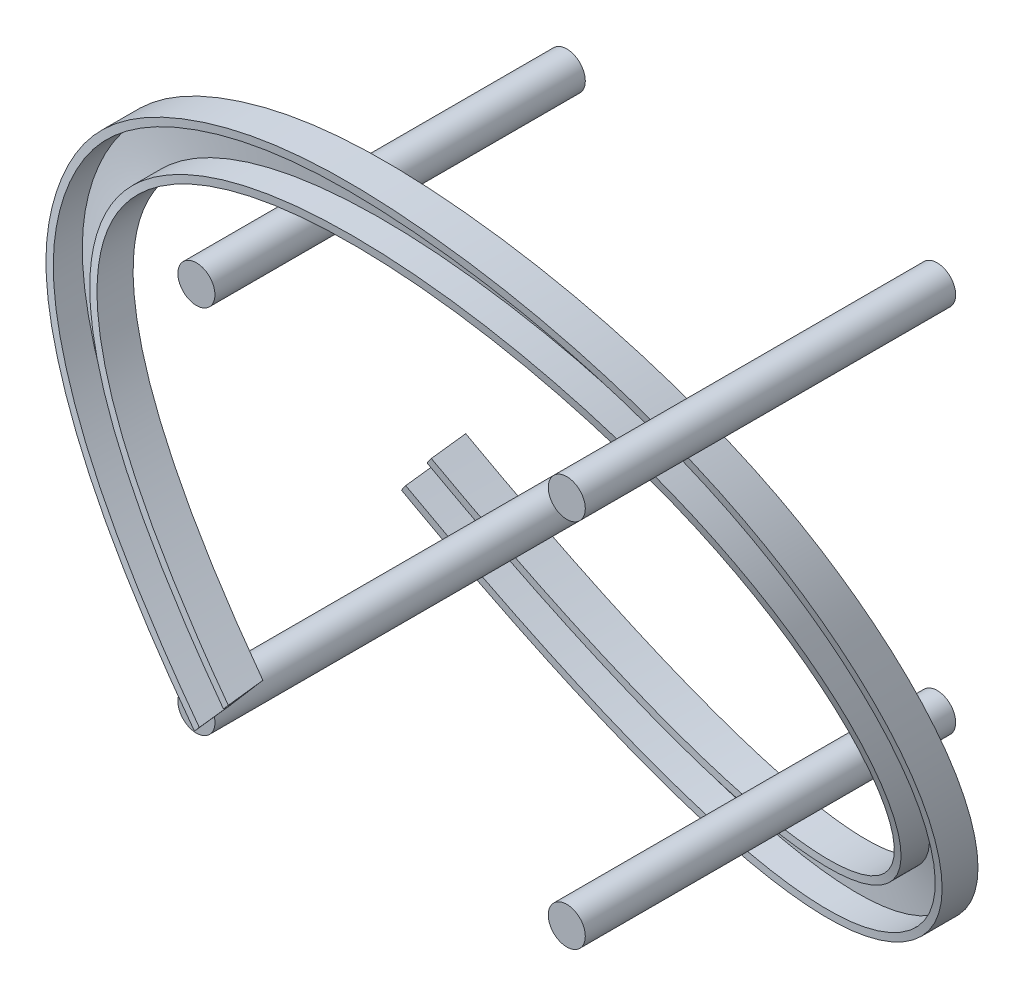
ISO-10303-21;
HEADER;
FILE_DESCRIPTION(('STEP AP214'),'2;1');
FILE_NAME('part.step','',(''),(''),'','','');
FILE_SCHEMA(('AUTOMOTIVE_DESIGN { 1 0 10303 214 1 1 1 1 }'));
ENDSEC;
DATA;
#1=APPLICATION_CONTEXT('core data for automotive mechanical design processes');
#2=APPLICATION_PROTOCOL_DEFINITION('international standard','automotive_design',2000,#1);
#3=PRODUCT_CONTEXT('',#1,'mechanical');
#4=PRODUCT('Part','Part','',(#3));
#5=PRODUCT_RELATED_PRODUCT_CATEGORY('part','',(#4));
#6=PRODUCT_DEFINITION_FORMATION('','',#4);
#7=PRODUCT_DEFINITION_CONTEXT('part definition',#1,'design');
#8=PRODUCT_DEFINITION('design','',#6,#7);
#9=PRODUCT_DEFINITION_SHAPE('','',#8);
#10=(LENGTH_UNIT() NAMED_UNIT(*) SI_UNIT(.MILLI.,.METRE.));
#11=(NAMED_UNIT(*) PLANE_ANGLE_UNIT() SI_UNIT($,.RADIAN.));
#12=(NAMED_UNIT(*) SI_UNIT($,.STERADIAN.) SOLID_ANGLE_UNIT());
#13=UNCERTAINTY_MEASURE_WITH_UNIT(LENGTH_MEASURE(1.E-05),#10,'distance_accuracy_value','');
#14=(GEOMETRIC_REPRESENTATION_CONTEXT(3) GLOBAL_UNCERTAINTY_ASSIGNED_CONTEXT((#13)) GLOBAL_UNIT_ASSIGNED_CONTEXT((#10,
#11,#12)) REPRESENTATION_CONTEXT('',''));
#15=CARTESIAN_POINT('',(0.,0.,0.));
#16=DIRECTION('',(0.,0.,1.));
#17=DIRECTION('',(1.,0.,0.));
#18=AXIS2_PLACEMENT_3D('',#15,#16,#17);
#19=CARTESIAN_POINT('',(-77.7613171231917,-50.7166657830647,9.96616393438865));
#20=CARTESIAN_POINT('',(-70.2801573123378,-55.968511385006,9.21165026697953));
#21=CARTESIAN_POINT('',(-55.8880572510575,-65.2955827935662,8.02362976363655));
#22=CARTESIAN_POINT('',(-29.3261450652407,-79.5413742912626,6.83805830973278));
#23=CARTESIAN_POINT('',(6.34820167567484,-91.9746411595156,7.54417392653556));
#24=CARTESIAN_POINT('',(40.8569061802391,-90.120545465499,13.0177509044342));
#25=CARTESIAN_POINT('',(64.3519997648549,-71.9275437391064,22.7748296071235));
#26=CARTESIAN_POINT('',(75.4857140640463,-41.7258650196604,35.8287291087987));
#27=CARTESIAN_POINT('',(69.3896475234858,-7.34019137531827,49.2249989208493));
#28=CARTESIAN_POINT('',(50.1268643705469,20.1377350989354,59.5248620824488));
#29=CARTESIAN_POINT('',(22.3316370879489,42.5422765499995,67.8998145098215));
#30=CARTESIAN_POINT('',(-20.7548953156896,60.2405934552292,75.4014445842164));
#31=CARTESIAN_POINT('',(-63.0830964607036,62.6392740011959,81.795131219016));
#32=CARTESIAN_POINT('',(-83.6748822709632,51.1117127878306,87.2817350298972));
#33=CARTESIAN_POINT('',(-87.7917811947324,35.3170567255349,91.9059318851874));
#34=CARTESIAN_POINT('',(-81.6955593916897,17.1834374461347,96.7966693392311));
#35=CARTESIAN_POINT('',(-67.6596586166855,-2.11885116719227,101.679685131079));
#36=CARTESIAN_POINT('',(-50.0130194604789,-20.3508399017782,106.190499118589));
#37=CARTESIAN_POINT('',(-38.9034197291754,-30.4265533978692,108.667366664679));
#38=CARTESIAN_POINT('',(-32.7326646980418,-35.7145213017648,109.966163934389));
#39=CARTESIAN_POINT('',(-76.6084745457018,-49.0823604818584,9.96574683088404));
#40=CARTESIAN_POINT('',(-69.1673767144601,-54.307029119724,9.21123316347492));
#41=CARTESIAN_POINT('',(-54.8554006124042,-63.5797466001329,8.02321266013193));
#42=CARTESIAN_POINT('',(-28.5018750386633,-77.7123603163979,6.83764120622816));
#43=CARTESIAN_POINT('',(6.7527595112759,-89.9777411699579,7.54375682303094));
#44=CARTESIAN_POINT('',(40.2862481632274,-88.0546648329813,13.0173338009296));
#45=CARTESIAN_POINT('',(62.6367929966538,-70.673355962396,22.7744125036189));
#46=CARTESIAN_POINT('',(73.3852290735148,-41.6528652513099,35.8283120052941));
#47=CARTESIAN_POINT('',(67.4655177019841,-8.08688294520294,49.2245818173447));
#48=CARTESIAN_POINT('',(48.6444524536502,18.758137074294,59.5244449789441));
#49=CARTESIAN_POINT('',(21.3655647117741,40.7472231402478,67.8993974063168));
#50=CARTESIAN_POINT('',(-21.2170765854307,58.3092429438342,75.4010274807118));
#51=CARTESIAN_POINT('',(-63.0787860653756,60.5043856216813,81.7947141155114));
#52=CARTESIAN_POINT('',(-82.0550854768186,49.5342147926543,87.2813179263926));
#53=CARTESIAN_POINT('',(-85.6464661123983,35.5547551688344,91.9055147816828));
#54=CARTESIAN_POINT('',(-79.9632474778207,18.2097370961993,96.7962522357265));
#55=CARTESIAN_POINT('',(-66.1318442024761,-0.819427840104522,101.679268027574));
#56=CARTESIAN_POINT('',(-48.6258235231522,-18.9080560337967,106.190082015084));
#57=CARTESIAN_POINT('',(-37.5715977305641,-28.9347442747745,108.666949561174));
#58=CARTESIAN_POINT('',(-31.4285296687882,-34.1981995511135,109.965746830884));
#59=B_SPLINE_SURFACE_WITH_KNOTS('',1,3,((#19,#20,#21,#22,#23,#24,#25,#26,#27,#28,#29,#30,#31,
#32,#33,#34,#35,#36,#37,#38),(#39,#40,#41,#42,#43,#44,#45,#46,#47,#48,#49,#50,#51,#52,#53,#54,
#55,#56,#57,#58)),.UNSPECIFIED.,.F.,.F.,.F.,(2,2),(4,1,1,1,1,1,1,1,1,1,1,1,1,1,1,1,1,4),(0.,
0.03125),(0.,0.0262499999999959,0.0524999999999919,0.105,0.187499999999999,0.257812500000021,
0.328125,0.43359375,0.494089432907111,0.5390625,0.64453125,0.75,0.8125,0.859375,
0.906250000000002,0.953125,0.9765625,1.),.UNSPECIFIED.);
#60=DIRECTION('',(-0.576421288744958,-0.817152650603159,0.000208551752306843));
#61=VECTOR('',#60,1.);
#62=CARTESIAN_POINT('',(-77.7613171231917,-50.7166657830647,9.96616393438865));
#63=LINE('',#62,#61);
#64=CARTESIAN_POINT('',(-76.6084745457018,-49.0823604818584,9.96574683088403));
#65=VERTEX_POINT('',#64);
#66=CARTESIAN_POINT('',(-77.7613171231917,-50.7166657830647,9.96616393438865));
#67=VERTEX_POINT('',#66);
#68=EDGE_CURVE('E213',#65,#67,#63,.T.);
#69=CARTESIAN_POINT('',(-77.7613171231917,-50.7166657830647,9.96616393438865));
#70=CARTESIAN_POINT('',(-70.2801573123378,-55.968511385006,9.21165026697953));
#71=CARTESIAN_POINT('',(-55.8880572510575,-65.2955827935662,8.02362976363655));
#72=CARTESIAN_POINT('',(-29.3261450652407,-79.5413742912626,6.83805830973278));
#73=CARTESIAN_POINT('',(6.34820167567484,-91.9746411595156,7.54417392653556));
#74=CARTESIAN_POINT('',(40.8569061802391,-90.120545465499,13.0177509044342));
#75=CARTESIAN_POINT('',(64.3519997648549,-71.9275437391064,22.7748296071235));
#76=CARTESIAN_POINT('',(75.4857140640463,-41.7258650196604,35.8287291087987));
#77=CARTESIAN_POINT('',(69.3896475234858,-7.34019137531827,49.2249989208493));
#78=CARTESIAN_POINT('',(50.1268643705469,20.1377350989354,59.5248620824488));
#79=CARTESIAN_POINT('',(22.3316370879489,42.5422765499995,67.8998145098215));
#80=CARTESIAN_POINT('',(-20.7548953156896,60.2405934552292,75.4014445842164));
#81=CARTESIAN_POINT('',(-63.0830964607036,62.6392740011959,81.795131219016));
#82=CARTESIAN_POINT('',(-83.6748822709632,51.1117127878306,87.2817350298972));
#83=CARTESIAN_POINT('',(-87.7917811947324,35.3170567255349,91.9059318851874));
#84=CARTESIAN_POINT('',(-81.6955593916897,17.1834374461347,96.7966693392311));
#85=CARTESIAN_POINT('',(-67.6596586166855,-2.11885116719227,101.679685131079));
#86=CARTESIAN_POINT('',(-50.0130194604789,-20.3508399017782,106.190499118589));
#87=CARTESIAN_POINT('',(-38.9034197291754,-30.4265533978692,108.667366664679));
#88=CARTESIAN_POINT('',(-32.7326646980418,-35.7145213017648,109.966163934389));
#89=B_SPLINE_CURVE_WITH_KNOTS('',3,(#69,#70,#71,#72,#73,#74,#75,#76,#77,#78,#79,#80,#81,#82,#83,
#84,#85,#86,#87,#88),.UNSPECIFIED.,.F.,.F.,(4,1,1,1,1,1,1,1,1,1,1,1,1,1,1,1,1,4),(0.,
0.0262499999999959,0.0524999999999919,0.105,0.187499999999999,0.257812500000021,0.328125,
0.43359375,0.494089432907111,0.5390625,0.64453125,0.75,0.8125,0.859375,0.906250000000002,
0.953125,0.9765625,1.),.UNSPECIFIED.);
#90=CARTESIAN_POINT('',(-32.7326646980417,-35.7145213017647,109.966163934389));
#91=VERTEX_POINT('',#90);
#92=EDGE_CURVE('E138',#67,#91,#89,.T.);
#93=DIRECTION('',(-0.652067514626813,-0.758160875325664,0.000208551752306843));
#94=VECTOR('',#93,1.);
#95=CARTESIAN_POINT('',(-32.7326646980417,-35.7145213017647,109.966163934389));
#96=LINE('',#95,#94);
#97=CARTESIAN_POINT('',(-31.4285296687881,-34.1981995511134,109.965746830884));
#98=VERTEX_POINT('',#97);
#99=EDGE_CURVE('E135',#98,#91,#96,.T.);
#100=CARTESIAN_POINT('',(-76.6084745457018,-49.0823604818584,9.96574683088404));
#101=CARTESIAN_POINT('',(-69.1673767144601,-54.307029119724,9.21123316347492));
#102=CARTESIAN_POINT('',(-54.8554006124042,-63.5797466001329,8.02321266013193));
#103=CARTESIAN_POINT('',(-28.5018750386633,-77.7123603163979,6.83764120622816));
#104=CARTESIAN_POINT('',(6.7527595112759,-89.9777411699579,7.54375682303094));
#105=CARTESIAN_POINT('',(40.2862481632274,-88.0546648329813,13.0173338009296));
#106=CARTESIAN_POINT('',(62.6367929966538,-70.673355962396,22.7744125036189));
#107=CARTESIAN_POINT('',(73.3852290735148,-41.6528652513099,35.8283120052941));
#108=CARTESIAN_POINT('',(67.4655177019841,-8.08688294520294,49.2245818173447));
#109=CARTESIAN_POINT('',(48.6444524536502,18.758137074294,59.5244449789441));
#110=CARTESIAN_POINT('',(21.3655647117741,40.7472231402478,67.8993974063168));
#111=CARTESIAN_POINT('',(-21.2170765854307,58.3092429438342,75.4010274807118));
#112=CARTESIAN_POINT('',(-63.0787860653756,60.5043856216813,81.7947141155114));
#113=CARTESIAN_POINT('',(-82.0550854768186,49.5342147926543,87.2813179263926));
#114=CARTESIAN_POINT('',(-85.6464661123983,35.5547551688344,91.9055147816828));
#115=CARTESIAN_POINT('',(-79.9632474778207,18.2097370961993,96.7962522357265));
#116=CARTESIAN_POINT('',(-66.1318442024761,-0.819427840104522,101.679268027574));
#117=CARTESIAN_POINT('',(-48.6258235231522,-18.9080560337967,106.190082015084));
#118=CARTESIAN_POINT('',(-37.5715977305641,-28.9347442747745,108.666949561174));
#119=CARTESIAN_POINT('',(-31.4285296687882,-34.1981995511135,109.965746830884));
#120=B_SPLINE_CURVE_WITH_KNOTS('',3,(#100,#101,#102,#103,#104,#105,#106,#107,#108,#109,#110,
#111,#112,#113,#114,#115,#116,#117,#118,#119),.UNSPECIFIED.,.F.,.F.,(4,1,1,1,1,1,1,1,1,1,1,1,1,
1,1,1,1,4),(0.,0.0262499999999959,0.0524999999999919,0.105,0.187499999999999,0.257812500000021,
0.328125,0.43359375,0.494089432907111,0.5390625,0.64453125,0.75,0.8125,0.859375,
0.906250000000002,0.953125,0.9765625,1.),.UNSPECIFIED.);
#121=EDGE_CURVE('E79',#65,#98,#120,.T.);
#122=ORIENTED_EDGE('',*,*,#68,.T.);
#123=ORIENTED_EDGE('',*,*,#92,.T.);
#124=ORIENTED_EDGE('',*,*,#99,.F.);
#125=ORIENTED_EDGE('',*,*,#121,.F.);
#126=EDGE_LOOP('',(#122,#123,#124,#125));
#127=FACE_BOUND('',#126,.T.);
#128=ADVANCED_FACE('F60',(#127),#59,.F.);
#129=CARTESIAN_POINT('',(-76.6084745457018,-49.0823604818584,9.96574683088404));
#130=CARTESIAN_POINT('',(-69.1673767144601,-54.307029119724,9.21123316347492));
#131=CARTESIAN_POINT('',(-54.8554006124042,-63.5797466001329,8.02321266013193));
#132=CARTESIAN_POINT('',(-28.5018750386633,-77.7123603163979,6.83764120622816));
#133=CARTESIAN_POINT('',(6.7527595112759,-89.9777411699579,7.54375682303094));
#134=CARTESIAN_POINT('',(40.2862481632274,-88.0546648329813,13.0173338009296));
#135=CARTESIAN_POINT('',(62.6367929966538,-70.673355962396,22.7744125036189));
#136=CARTESIAN_POINT('',(73.3852290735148,-41.6528652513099,35.8283120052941));
#137=CARTESIAN_POINT('',(67.4655177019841,-8.08688294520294,49.2245818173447));
#138=CARTESIAN_POINT('',(48.6444524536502,18.758137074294,59.5244449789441));
#139=CARTESIAN_POINT('',(21.3655647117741,40.7472231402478,67.8993974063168));
#140=CARTESIAN_POINT('',(-21.2170765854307,58.3092429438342,75.4010274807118));
#141=CARTESIAN_POINT('',(-63.0787860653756,60.5043856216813,81.7947141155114));
#142=CARTESIAN_POINT('',(-82.0550854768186,49.5342147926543,87.2813179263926));
#143=CARTESIAN_POINT('',(-85.6464661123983,35.5547551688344,91.9055147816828));
#144=CARTESIAN_POINT('',(-79.9632474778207,18.2097370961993,96.7962522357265));
#145=CARTESIAN_POINT('',(-66.1318442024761,-0.819427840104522,101.679268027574));
#146=CARTESIAN_POINT('',(-48.6258235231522,-18.9080560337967,106.190082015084));
#147=CARTESIAN_POINT('',(-37.5715977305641,-28.9347442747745,108.666949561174));
#148=CARTESIAN_POINT('',(-31.4285296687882,-34.1981995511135,109.965746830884));
#149=CARTESIAN_POINT('',(-77.2854364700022,-48.60737347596,0.));
#150=CARTESIAN_POINT('',(-69.8555343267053,-53.8486354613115,-0.754513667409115));
#151=CARTESIAN_POINT('',(-55.5659496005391,-63.1545396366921,-1.9425341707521));
#152=CARTESIAN_POINT('',(-29.2590050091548,-77.3734361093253,-3.12810562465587));
#153=CARTESIAN_POINT('',(5.92664702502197,-89.8125369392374,-2.42199000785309));
#154=CARTESIAN_POINT('',(39.4326265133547,-88.2927713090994,3.05158697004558));
#155=CARTESIAN_POINT('',(62.1199851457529,-71.3838749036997,12.8086656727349));
#156=CARTESIAN_POINT('',(73.3572274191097,-42.5214642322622,25.8625651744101));
#157=CARTESIAN_POINT('',(67.7762644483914,-8.88170955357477,39.2588349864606));
#158=CARTESIAN_POINT('',(49.2164387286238,18.1466127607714,49.5586981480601));
#159=CARTESIAN_POINT('',(22.1087997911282,40.3496302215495,57.9336505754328));
#160=CARTESIAN_POINT('',(-20.4180080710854,58.1201440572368,65.4352806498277));
#161=CARTESIAN_POINT('',(-62.1960420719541,60.5083864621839,71.8289672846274));
#162=CARTESIAN_POINT('',(-81.4044939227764,50.2056189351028,77.3155710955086));
#163=CARTESIAN_POINT('',(-85.7469806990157,36.4415679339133,81.9397679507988));
#164=CARTESIAN_POINT('',(-80.3894091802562,18.9249589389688,86.8305054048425));
#165=CARTESIAN_POINT('',(-66.6707264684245,-0.189046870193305,91.7135211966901));
#166=CARTESIAN_POINT('',(-49.2238373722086,-18.3359679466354,96.2243351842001));
#167=CARTESIAN_POINT('',(-38.189825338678,-28.3856035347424,98.7012027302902));
#168=CARTESIAN_POINT('',(-32.0568641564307,-33.660532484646,100.));
#169=B_SPLINE_SURFACE_WITH_KNOTS('',1,3,((#129,#130,#131,#132,#133,#134,#135,#136,#137,#138,
#139,#140,#141,#142,#143,#144,#145,#146,#147,#148),(#149,#150,#151,#152,#153,#154,#155,#156,
#157,#158,#159,#160,#161,#162,#163,#164,#165,#166,#167,#168)),.UNSPECIFIED.,.F.,.F.,.F.,(2,2),
(4,1,1,1,1,1,1,1,1,1,1,1,1,1,1,1,1,4),(0.03125,0.1875),(0.,0.0262499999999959,
0.0524999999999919,0.105,0.187499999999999,0.257812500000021,0.328125,0.43359375,
0.494089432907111,0.5390625,0.64453125,0.75,0.8125,0.859375,0.906250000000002,0.953125,
0.9765625,1.),.UNSPECIFIED.);
#170=DIRECTION('',(0.0676961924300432,-0.0474987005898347,0.996574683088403));
#171=VECTOR('',#170,1.);
#172=CARTESIAN_POINT('',(-76.6084745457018,-49.0823604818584,9.96574683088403));
#173=LINE('',#172,#171);
#174=CARTESIAN_POINT('',(-77.2854364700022,-48.60737347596,0.));
#175=VERTEX_POINT('',#174);
#176=EDGE_CURVE('E13',#175,#65,#173,.T.);
#177=DIRECTION('',(0.0628334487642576,-0.0537667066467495,0.996574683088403));
#178=VECTOR('',#177,1.);
#179=CARTESIAN_POINT('',(-31.4285296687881,-34.1981995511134,109.965746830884));
#180=LINE('',#179,#178);
#181=CARTESIAN_POINT('',(-32.0568641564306,-33.6605324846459,100.));
#182=VERTEX_POINT('',#181);
#183=EDGE_CURVE('E64',#182,#98,#180,.T.);
#184=CARTESIAN_POINT('',(-77.2854364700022,-48.60737347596,0.));
#185=CARTESIAN_POINT('',(-69.8555343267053,-53.8486354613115,-0.754513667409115));
#186=CARTESIAN_POINT('',(-55.5659496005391,-63.1545396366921,-1.9425341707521));
#187=CARTESIAN_POINT('',(-29.2590050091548,-77.3734361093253,-3.12810562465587));
#188=CARTESIAN_POINT('',(5.92664702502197,-89.8125369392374,-2.42199000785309));
#189=CARTESIAN_POINT('',(39.4326265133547,-88.2927713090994,3.05158697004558));
#190=CARTESIAN_POINT('',(62.1199851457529,-71.3838749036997,12.8086656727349));
#191=CARTESIAN_POINT('',(73.3572274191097,-42.5214642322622,25.8625651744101));
#192=CARTESIAN_POINT('',(67.7762644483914,-8.88170955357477,39.2588349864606));
#193=CARTESIAN_POINT('',(49.2164387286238,18.1466127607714,49.5586981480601));
#194=CARTESIAN_POINT('',(22.1087997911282,40.3496302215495,57.9336505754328));
#195=CARTESIAN_POINT('',(-20.4180080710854,58.1201440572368,65.4352806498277));
#196=CARTESIAN_POINT('',(-62.1960420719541,60.5083864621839,71.8289672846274));
#197=CARTESIAN_POINT('',(-81.4044939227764,50.2056189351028,77.3155710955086));
#198=CARTESIAN_POINT('',(-85.7469806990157,36.4415679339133,81.9397679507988));
#199=CARTESIAN_POINT('',(-80.3894091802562,18.9249589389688,86.8305054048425));
#200=CARTESIAN_POINT('',(-66.6707264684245,-0.189046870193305,91.7135211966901));
#201=CARTESIAN_POINT('',(-49.2238373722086,-18.3359679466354,96.2243351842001));
#202=CARTESIAN_POINT('',(-38.189825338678,-28.3856035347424,98.7012027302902));
#203=CARTESIAN_POINT('',(-32.0568641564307,-33.660532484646,100.));
#204=B_SPLINE_CURVE_WITH_KNOTS('',3,(#184,#185,#186,#187,#188,#189,#190,#191,#192,#193,#194,
#195,#196,#197,#198,#199,#200,#201,#202,#203),.UNSPECIFIED.,.F.,.F.,(4,1,1,1,1,1,1,1,1,1,1,1,1,
1,1,1,1,4),(0.,0.0262499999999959,0.0524999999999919,0.105,0.187499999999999,0.257812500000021,
0.328125,0.43359375,0.494089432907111,0.5390625,0.64453125,0.75,0.8125,0.859375,
0.906250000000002,0.953125,0.9765625,1.),.UNSPECIFIED.);
#205=EDGE_CURVE('E123',#175,#182,#204,.T.);
#206=ORIENTED_EDGE('',*,*,#176,.T.);
#207=ORIENTED_EDGE('',*,*,#121,.T.);
#208=ORIENTED_EDGE('',*,*,#183,.F.);
#209=ORIENTED_EDGE('',*,*,#205,.F.);
#210=EDGE_LOOP('',(#206,#207,#208,#209));
#211=FACE_BOUND('',#210,.T.);
#212=ADVANCED_FACE('F127',(#211),#169,.F.);
#213=CARTESIAN_POINT('',(-77.2854364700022,-48.60737347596,0.));
#214=CARTESIAN_POINT('',(-69.8555343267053,-53.8486354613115,-0.754513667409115));
#215=CARTESIAN_POINT('',(-55.5659496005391,-63.1545396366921,-1.9425341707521));
#216=CARTESIAN_POINT('',(-29.2590050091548,-77.3734361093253,-3.12810562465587));
#217=CARTESIAN_POINT('',(5.92664702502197,-89.8125369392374,-2.42199000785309));
#218=CARTESIAN_POINT('',(39.4326265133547,-88.2927713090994,3.05158697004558));
#219=CARTESIAN_POINT('',(62.1199851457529,-71.3838749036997,12.8086656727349));
#220=CARTESIAN_POINT('',(73.3572274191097,-42.5214642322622,25.8625651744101));
#221=CARTESIAN_POINT('',(67.7762644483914,-8.88170955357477,39.2588349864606));
#222=CARTESIAN_POINT('',(49.2164387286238,18.1466127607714,49.5586981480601));
#223=CARTESIAN_POINT('',(22.1087997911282,40.3496302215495,57.9336505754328));
#224=CARTESIAN_POINT('',(-20.4180080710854,58.1201440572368,65.4352806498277));
#225=CARTESIAN_POINT('',(-62.1960420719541,60.5083864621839,71.8289672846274));
#226=CARTESIAN_POINT('',(-81.4044939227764,50.2056189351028,77.3155710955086));
#227=CARTESIAN_POINT('',(-85.7469806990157,36.4415679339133,81.9397679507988));
#228=CARTESIAN_POINT('',(-80.3894091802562,18.9249589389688,86.8305054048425));
#229=CARTESIAN_POINT('',(-66.6707264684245,-0.189046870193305,91.7135211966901));
#230=CARTESIAN_POINT('',(-49.2238373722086,-18.3359679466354,96.2243351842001));
#231=CARTESIAN_POINT('',(-38.189825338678,-28.3856035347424,98.7012027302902));
#232=CARTESIAN_POINT('',(-32.0568641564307,-33.660532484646,100.));
#233=CARTESIAN_POINT('',(-85.3553345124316,-60.0475105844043,0.00291972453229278));
#234=CARTESIAN_POINT('',(-77.6449985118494,-65.4790113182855,-0.751593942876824));
#235=CARTESIAN_POINT('',(-62.7945460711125,-75.1653929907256,-1.93961444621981));
#236=CARTESIAN_POINT('',(-35.0288951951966,-90.1765339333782,-3.12518590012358));
#237=CARTESIAN_POINT('',(3.09474217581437,-103.790836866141,-2.4190702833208));
#238=CARTESIAN_POINT('',(43.4272326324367,-102.753935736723,3.05450669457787));
#239=CARTESIAN_POINT('',(74.1264325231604,-80.1631893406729,12.8115853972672));
#240=CARTESIAN_POINT('',(88.0606223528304,-43.0324626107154,25.8654848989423));
#241=CARTESIAN_POINT('',(81.2451731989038,-3.654868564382,39.2617547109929));
#242=CARTESIAN_POINT('',(59.5933221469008,27.8037989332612,49.5616178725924));
#243=CARTESIAN_POINT('',(28.8713064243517,52.9150040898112,57.9365702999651));
#244=CARTESIAN_POINT('',(-17.1827391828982,71.6395976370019,65.43820037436));
#245=CARTESIAN_POINT('',(-62.2262148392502,75.4526051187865,71.8318870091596));
#246=CARTESIAN_POINT('',(-92.7430714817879,61.2481049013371,77.3184908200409));
#247=CARTESIAN_POINT('',(-100.764186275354,34.7776788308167,81.942687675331));
#248=CARTESIAN_POINT('',(-92.5155925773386,11.7408613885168,86.8334251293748));
#249=CARTESIAN_POINT('',(-77.3654273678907,-9.28501015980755,91.7164409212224));
#250=CARTESIAN_POINT('',(-58.934208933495,-28.4354550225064,96.2272549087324));
#251=CARTESIAN_POINT('',(-47.512579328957,-38.8282673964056,98.7041224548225));
#252=CARTESIAN_POINT('',(-41.1858093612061,-44.2747847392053,100.002919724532));
#253=B_SPLINE_SURFACE_WITH_KNOTS('',1,3,((#213,#214,#215,#216,#217,#218,#219,#220,#221,#222,
#223,#224,#225,#226,#227,#228,#229,#230,#231,#232),(#233,#234,#235,#236,#237,#238,#239,#240,
#241,#242,#243,#244,#245,#246,#247,#248,#249,#250,#251,#252)),.UNSPECIFIED.,.F.,.F.,.F.,(2,2),
(4,1,1,1,1,1,1,1,1,1,1,1,1,1,1,1,1,4),(0.1875,0.40625),(0.,0.0262499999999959,
0.0524999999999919,0.105,0.187499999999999,0.257812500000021,0.328125,0.43359375,
0.494089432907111,0.5390625,0.64453125,0.75,0.8125,0.859375,0.906250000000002,0.953125,
0.9765625,1.),.UNSPECIFIED.);
#254=DIRECTION('',(0.576421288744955,0.817152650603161,-0.000208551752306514));
#255=VECTOR('',#254,1.);
#256=CARTESIAN_POINT('',(-77.2854364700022,-48.60737347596,0.));
#257=LINE('',#256,#255);
#258=CARTESIAN_POINT('',(-85.3553345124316,-60.0475105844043,0.00291972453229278));
#259=VERTEX_POINT('',#258);
#260=EDGE_CURVE('E70',#259,#175,#257,.T.);
#261=DIRECTION('',(0.65206751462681,0.758160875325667,-0.000208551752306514));
#262=VECTOR('',#261,1.);
#263=CARTESIAN_POINT('',(-32.0568641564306,-33.6605324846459,100.));
#264=LINE('',#263,#262);
#265=CARTESIAN_POINT('',(-41.185809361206,-44.2747847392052,100.002919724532));
#266=VERTEX_POINT('',#265);
#267=EDGE_CURVE('E137',#266,#182,#264,.T.);
#268=CARTESIAN_POINT('',(-85.3553345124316,-60.0475105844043,0.00291972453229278));
#269=CARTESIAN_POINT('',(-77.6449985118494,-65.4790113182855,-0.751593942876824));
#270=CARTESIAN_POINT('',(-62.7945460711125,-75.1653929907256,-1.93961444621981));
#271=CARTESIAN_POINT('',(-35.0288951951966,-90.1765339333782,-3.12518590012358));
#272=CARTESIAN_POINT('',(3.09474217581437,-103.790836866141,-2.4190702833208));
#273=CARTESIAN_POINT('',(43.4272326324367,-102.753935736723,3.05450669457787));
#274=CARTESIAN_POINT('',(74.1264325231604,-80.1631893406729,12.8115853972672));
#275=CARTESIAN_POINT('',(88.0606223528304,-43.0324626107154,25.8654848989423));
#276=CARTESIAN_POINT('',(81.2451731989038,-3.654868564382,39.2617547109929));
#277=CARTESIAN_POINT('',(59.5933221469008,27.8037989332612,49.5616178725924));
#278=CARTESIAN_POINT('',(28.8713064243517,52.9150040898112,57.9365702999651));
#279=CARTESIAN_POINT('',(-17.1827391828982,71.6395976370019,65.43820037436));
#280=CARTESIAN_POINT('',(-62.2262148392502,75.4526051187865,71.8318870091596));
#281=CARTESIAN_POINT('',(-92.7430714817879,61.2481049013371,77.3184908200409));
#282=CARTESIAN_POINT('',(-100.764186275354,34.7776788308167,81.942687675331));
#283=CARTESIAN_POINT('',(-92.5155925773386,11.7408613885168,86.8334251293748));
#284=CARTESIAN_POINT('',(-77.3654273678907,-9.28501015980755,91.7164409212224));
#285=CARTESIAN_POINT('',(-58.934208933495,-28.4354550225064,96.2272549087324));
#286=CARTESIAN_POINT('',(-47.512579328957,-38.8282673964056,98.7041224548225));
#287=CARTESIAN_POINT('',(-41.1858093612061,-44.2747847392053,100.002919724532));
#288=B_SPLINE_CURVE_WITH_KNOTS('',3,(#268,#269,#270,#271,#272,#273,#274,#275,#276,#277,#278,
#279,#280,#281,#282,#283,#284,#285,#286,#287),.UNSPECIFIED.,.F.,.F.,(4,1,1,1,1,1,1,1,1,1,1,1,1,
1,1,1,1,4),(0.,0.0262499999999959,0.0524999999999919,0.105,0.187499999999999,0.257812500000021,
0.328125,0.43359375,0.494089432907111,0.5390625,0.64453125,0.75,0.8125,0.859375,
0.906250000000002,0.953125,0.9765625,1.),.UNSPECIFIED.);
#289=EDGE_CURVE('E166',#259,#266,#288,.T.);
#290=ORIENTED_EDGE('',*,*,#260,.T.);
#291=ORIENTED_EDGE('',*,*,#205,.T.);
#292=ORIENTED_EDGE('',*,*,#267,.F.);
#293=ORIENTED_EDGE('',*,*,#289,.F.);
#294=EDGE_LOOP('',(#290,#291,#292,#293));
#295=FACE_BOUND('',#294,.T.);
#296=ADVANCED_FACE('F171',(#295),#253,.F.);
#297=CARTESIAN_POINT('',(-85.3553345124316,-60.0475105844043,0.00291972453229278));
#298=CARTESIAN_POINT('',(-77.6449985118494,-65.4790113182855,-0.751593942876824));
#299=CARTESIAN_POINT('',(-62.7945460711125,-75.1653929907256,-1.93961444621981));
#300=CARTESIAN_POINT('',(-35.0288951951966,-90.1765339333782,-3.12518590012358));
#301=CARTESIAN_POINT('',(3.09474217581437,-103.790836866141,-2.4190702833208));
#302=CARTESIAN_POINT('',(43.4272326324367,-102.753935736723,3.05450669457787));
#303=CARTESIAN_POINT('',(74.1264325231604,-80.1631893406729,12.8115853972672));
#304=CARTESIAN_POINT('',(88.0606223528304,-43.0324626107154,25.8654848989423));
#305=CARTESIAN_POINT('',(81.2451731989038,-3.654868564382,39.2617547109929));
#306=CARTESIAN_POINT('',(59.5933221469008,27.8037989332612,49.5616178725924));
#307=CARTESIAN_POINT('',(28.8713064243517,52.9150040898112,57.9365702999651));
#308=CARTESIAN_POINT('',(-17.1827391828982,71.6395976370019,65.43820037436));
#309=CARTESIAN_POINT('',(-62.2262148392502,75.4526051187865,71.8318870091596));
#310=CARTESIAN_POINT('',(-92.7430714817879,61.2481049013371,77.3184908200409));
#311=CARTESIAN_POINT('',(-100.764186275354,34.7776788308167,81.942687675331));
#312=CARTESIAN_POINT('',(-92.5155925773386,11.7408613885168,86.8334251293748));
#313=CARTESIAN_POINT('',(-77.3654273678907,-9.28501015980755,91.7164409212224));
#314=CARTESIAN_POINT('',(-58.934208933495,-28.4354550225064,96.2272549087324));
#315=CARTESIAN_POINT('',(-47.512579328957,-38.8282673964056,98.7041224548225));
#316=CARTESIAN_POINT('',(-41.1858093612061,-44.2747847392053,100.002919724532));
#317=CARTESIAN_POINT('',(-84.6783725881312,-60.5224975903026,9.96866655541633));
#318=CARTESIAN_POINT('',(-76.9568408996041,-65.937404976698,9.21415288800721));
#319=CARTESIAN_POINT('',(-62.0839970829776,-75.5905999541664,8.02613238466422));
#320=CARTESIAN_POINT('',(-34.2717652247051,-90.5154581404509,6.84056093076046));
#321=CARTESIAN_POINT('',(3.92085466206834,-103.956041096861,7.54667654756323));
#322=CARTESIAN_POINT('',(44.2808542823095,-102.515829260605,13.0202535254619));
#323=CARTESIAN_POINT('',(74.6432403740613,-79.4526703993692,22.7773322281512));
#324=CARTESIAN_POINT('',(88.0886240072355,-42.1638636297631,35.8312317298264));
#325=CARTESIAN_POINT('',(80.9344264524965,-2.86004195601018,49.2275015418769));
#326=CARTESIAN_POINT('',(59.0213358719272,28.4153232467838,59.5273647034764));
#327=CARTESIAN_POINT('',(28.1280713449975,53.3125970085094,67.9023171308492));
#328=CARTESIAN_POINT('',(-17.9818076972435,71.8286965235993,75.4039472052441));
#329=CARTESIAN_POINT('',(-63.1089588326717,75.4486042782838,81.7976338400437));
#330=CARTESIAN_POINT('',(-93.3936630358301,60.5767007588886,87.2842376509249));
#331=CARTESIAN_POINT('',(-100.663671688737,33.8908660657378,91.9084345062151));
#332=CARTESIAN_POINT('',(-92.0894308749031,11.0256395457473,96.7991719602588));
#333=CARTESIAN_POINT('',(-76.8265451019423,-9.91539112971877,101.682187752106));
#334=CARTESIAN_POINT('',(-58.3361950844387,-29.0075431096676,106.193001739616));
#335=CARTESIAN_POINT('',(-46.8943517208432,-39.3774081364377,108.669869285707));
#336=CARTESIAN_POINT('',(-40.5574748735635,-44.8124518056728,109.968666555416));
#337=B_SPLINE_SURFACE_WITH_KNOTS('',1,3,((#297,#298,#299,#300,#301,#302,#303,#304,#305,#306,
#307,#308,#309,#310,#311,#312,#313,#314,#315,#316),(#317,#318,#319,#320,#321,#322,#323,#324,
#325,#326,#327,#328,#329,#330,#331,#332,#333,#334,#335,#336)),.UNSPECIFIED.,.F.,.F.,.F.,(2,2),
(4,1,1,1,1,1,1,1,1,1,1,1,1,1,1,1,1,4),(0.40625,0.5625),(0.,0.0262499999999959,
0.0524999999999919,0.105,0.187499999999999,0.257812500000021,0.328125,0.43359375,
0.494089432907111,0.5390625,0.64453125,0.75,0.8125,0.859375,0.906250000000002,0.953125,
0.9765625,1.),.UNSPECIFIED.);
#338=DIRECTION('',(-0.0676961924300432,0.0474987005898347,-0.996574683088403));
#339=VECTOR('',#338,1.);
#340=CARTESIAN_POINT('',(-85.3553345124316,-60.0475105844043,0.00291972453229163));
#341=LINE('',#340,#339);
#342=CARTESIAN_POINT('',(-84.6783725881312,-60.5224975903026,9.96866655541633));
#343=VERTEX_POINT('',#342);
#344=EDGE_CURVE('E168',#343,#259,#341,.T.);
#345=DIRECTION('',(-0.0628334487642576,0.0537667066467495,-0.996574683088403));
#346=VECTOR('',#345,1.);
#347=CARTESIAN_POINT('',(-41.185809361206,-44.2747847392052,100.002919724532));
#348=LINE('',#347,#346);
#349=CARTESIAN_POINT('',(-40.5574748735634,-44.8124518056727,109.968666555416));
#350=VERTEX_POINT('',#349);
#351=EDGE_CURVE('E158',#350,#266,#348,.T.);
#352=CARTESIAN_POINT('',(-84.6783725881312,-60.5224975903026,9.96866655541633));
#353=CARTESIAN_POINT('',(-76.9568408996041,-65.937404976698,9.21415288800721));
#354=CARTESIAN_POINT('',(-62.0839970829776,-75.5905999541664,8.02613238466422));
#355=CARTESIAN_POINT('',(-34.2717652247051,-90.5154581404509,6.84056093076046));
#356=CARTESIAN_POINT('',(3.92085466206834,-103.956041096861,7.54667654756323));
#357=CARTESIAN_POINT('',(44.2808542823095,-102.515829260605,13.0202535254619));
#358=CARTESIAN_POINT('',(74.6432403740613,-79.4526703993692,22.7773322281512));
#359=CARTESIAN_POINT('',(88.0886240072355,-42.1638636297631,35.8312317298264));
#360=CARTESIAN_POINT('',(80.9344264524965,-2.86004195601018,49.2275015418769));
#361=CARTESIAN_POINT('',(59.0213358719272,28.4153232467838,59.5273647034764));
#362=CARTESIAN_POINT('',(28.1280713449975,53.3125970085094,67.9023171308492));
#363=CARTESIAN_POINT('',(-17.9818076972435,71.8286965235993,75.4039472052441));
#364=CARTESIAN_POINT('',(-63.1089588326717,75.4486042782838,81.7976338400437));
#365=CARTESIAN_POINT('',(-93.3936630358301,60.5767007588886,87.2842376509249));
#366=CARTESIAN_POINT('',(-100.663671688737,33.8908660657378,91.9084345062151));
#367=CARTESIAN_POINT('',(-92.0894308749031,11.0256395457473,96.7991719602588));
#368=CARTESIAN_POINT('',(-76.8265451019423,-9.91539112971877,101.682187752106));
#369=CARTESIAN_POINT('',(-58.3361950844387,-29.0075431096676,106.193001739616));
#370=CARTESIAN_POINT('',(-46.8943517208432,-39.3774081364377,108.669869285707));
#371=CARTESIAN_POINT('',(-40.5574748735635,-44.8124518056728,109.968666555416));
#372=B_SPLINE_CURVE_WITH_KNOTS('',3,(#352,#353,#354,#355,#356,#357,#358,#359,#360,#361,#362,
#363,#364,#365,#366,#367,#368,#369,#370,#371),.UNSPECIFIED.,.F.,.F.,(4,1,1,1,1,1,1,1,1,1,1,1,1,
1,1,1,1,4),(0.,0.0262499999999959,0.0524999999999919,0.105,0.187499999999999,0.257812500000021,
0.328125,0.43359375,0.494089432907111,0.5390625,0.64453125,0.75,0.8125,0.859375,
0.906250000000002,0.953125,0.9765625,1.),.UNSPECIFIED.);
#373=EDGE_CURVE('E164',#343,#350,#372,.T.);
#374=ORIENTED_EDGE('',*,*,#344,.T.);
#375=ORIENTED_EDGE('',*,*,#289,.T.);
#376=ORIENTED_EDGE('',*,*,#351,.F.);
#377=ORIENTED_EDGE('',*,*,#373,.F.);
#378=EDGE_LOOP('',(#374,#375,#376,#377));
#379=FACE_BOUND('',#378,.T.);
#380=ADVANCED_FACE('F163',(#379),#337,.F.);
#381=CARTESIAN_POINT('',(-84.6783725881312,-60.5224975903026,9.96866655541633));
#382=CARTESIAN_POINT('',(-76.9568408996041,-65.937404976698,9.21415288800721));
#383=CARTESIAN_POINT('',(-62.0839970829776,-75.5905999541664,8.02613238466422));
#384=CARTESIAN_POINT('',(-34.2717652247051,-90.5154581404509,6.84056093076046));
#385=CARTESIAN_POINT('',(3.92085466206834,-103.956041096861,7.54667654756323));
#386=CARTESIAN_POINT('',(44.2808542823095,-102.515829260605,13.0202535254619));
#387=CARTESIAN_POINT('',(74.6432403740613,-79.4526703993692,22.7773322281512));
#388=CARTESIAN_POINT('',(88.0886240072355,-42.1638636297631,35.8312317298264));
#389=CARTESIAN_POINT('',(80.9344264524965,-2.86004195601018,49.2275015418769));
#390=CARTESIAN_POINT('',(59.0213358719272,28.4153232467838,59.5273647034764));
#391=CARTESIAN_POINT('',(28.1280713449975,53.3125970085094,67.9023171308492));
#392=CARTESIAN_POINT('',(-17.9818076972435,71.8286965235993,75.4039472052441));
#393=CARTESIAN_POINT('',(-63.1089588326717,75.4486042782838,81.7976338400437));
#394=CARTESIAN_POINT('',(-93.3936630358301,60.5767007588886,87.2842376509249));
#395=CARTESIAN_POINT('',(-100.663671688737,33.8908660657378,91.9084345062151));
#396=CARTESIAN_POINT('',(-92.0894308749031,11.0256395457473,96.7991719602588));
#397=CARTESIAN_POINT('',(-76.8265451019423,-9.91539112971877,101.682187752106));
#398=CARTESIAN_POINT('',(-58.3361950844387,-29.0075431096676,106.193001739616));
#399=CARTESIAN_POINT('',(-46.8943517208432,-39.3774081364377,108.669869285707));
#400=CARTESIAN_POINT('',(-40.5574748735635,-44.8124518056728,109.968666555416));
#401=CARTESIAN_POINT('',(-83.5255300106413,-58.8881922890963,9.96824945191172));
#402=CARTESIAN_POINT('',(-75.8440603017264,-64.275922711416,9.2137357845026));
#403=CARTESIAN_POINT('',(-61.0513404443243,-73.874763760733,8.02571528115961));
#404=CARTESIAN_POINT('',(-33.4474951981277,-88.6864441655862,6.84014382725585));
#405=CARTESIAN_POINT('',(4.32541249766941,-101.959141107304,7.54625944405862));
#406=CARTESIAN_POINT('',(43.7101962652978,-100.449948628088,13.0198364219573));
#407=CARTESIAN_POINT('',(72.9280336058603,-78.1984826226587,22.7769151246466));
#408=CARTESIAN_POINT('',(85.988139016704,-42.0908638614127,35.8308146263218));
#409=CARTESIAN_POINT('',(79.0102966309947,-3.60673352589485,49.2270844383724));
#410=CARTESIAN_POINT('',(57.5389239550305,27.0357252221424,59.5269475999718));
#411=CARTESIAN_POINT('',(27.1619989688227,51.5175435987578,67.9019000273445));
#412=CARTESIAN_POINT('',(-18.4439889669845,69.8973460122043,75.4035301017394));
#413=CARTESIAN_POINT('',(-63.1046484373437,73.3137158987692,81.7972167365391));
#414=CARTESIAN_POINT('',(-91.7738662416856,58.9992027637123,87.2838205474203));
#415=CARTESIAN_POINT('',(-98.5183566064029,34.1285645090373,91.9080174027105));
#416=CARTESIAN_POINT('',(-90.3571189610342,12.0519391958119,96.7987548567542));
#417=CARTESIAN_POINT('',(-75.2987306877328,-8.61596780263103,101.681770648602));
#418=CARTESIAN_POINT('',(-56.9489991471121,-27.5647592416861,106.192584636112));
#419=CARTESIAN_POINT('',(-45.5625297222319,-37.885599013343,108.669452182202));
#420=CARTESIAN_POINT('',(-39.2533398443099,-43.2961300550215,109.968249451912));
#421=B_SPLINE_SURFACE_WITH_KNOTS('',1,3,((#381,#382,#383,#384,#385,#386,#387,#388,#389,#390,
#391,#392,#393,#394,#395,#396,#397,#398,#399,#400),(#401,#402,#403,#404,#405,#406,#407,#408,
#409,#410,#411,#412,#413,#414,#415,#416,#417,#418,#419,#420)),.UNSPECIFIED.,.F.,.F.,.F.,(2,2),
(4,1,1,1,1,1,1,1,1,1,1,1,1,1,1,1,1,4),(0.5625,0.59375),(0.,0.0262499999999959,
0.0524999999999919,0.105,0.187499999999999,0.257812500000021,0.328125,0.43359375,
0.494089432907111,0.5390625,0.64453125,0.75,0.8125,0.859375,0.906250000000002,0.953125,
0.9765625,1.),.UNSPECIFIED.);
#422=DIRECTION('',(-0.576421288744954,-0.817152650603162,0.000208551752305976));
#423=VECTOR('',#422,1.);
#424=CARTESIAN_POINT('',(-84.6783725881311,-60.5224975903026,9.96866655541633));
#425=LINE('',#424,#423);
#426=CARTESIAN_POINT('',(-83.5255300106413,-58.8881922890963,9.96824945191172));
#427=VERTEX_POINT('',#426);
#428=EDGE_CURVE('E227',#427,#343,#425,.T.);
#429=DIRECTION('',(-0.652067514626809,-0.758160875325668,0.000208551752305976));
#430=VECTOR('',#429,1.);
#431=CARTESIAN_POINT('',(-40.5574748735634,-44.8124518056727,109.968666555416));
#432=LINE('',#431,#430);
#433=CARTESIAN_POINT('',(-39.2533398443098,-43.2961300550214,109.968249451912));
#434=VERTEX_POINT('',#433);
#435=EDGE_CURVE('E155',#434,#350,#432,.T.);
#436=CARTESIAN_POINT('',(-83.5255300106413,-58.8881922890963,9.96824945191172));
#437=CARTESIAN_POINT('',(-75.8440603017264,-64.275922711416,9.2137357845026));
#438=CARTESIAN_POINT('',(-61.0513404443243,-73.874763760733,8.02571528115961));
#439=CARTESIAN_POINT('',(-33.4474951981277,-88.6864441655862,6.84014382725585));
#440=CARTESIAN_POINT('',(4.32541249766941,-101.959141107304,7.54625944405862));
#441=CARTESIAN_POINT('',(43.7101962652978,-100.449948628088,13.0198364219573));
#442=CARTESIAN_POINT('',(72.9280336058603,-78.1984826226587,22.7769151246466));
#443=CARTESIAN_POINT('',(85.988139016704,-42.0908638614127,35.8308146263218));
#444=CARTESIAN_POINT('',(79.0102966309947,-3.60673352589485,49.2270844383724));
#445=CARTESIAN_POINT('',(57.5389239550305,27.0357252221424,59.5269475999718));
#446=CARTESIAN_POINT('',(27.1619989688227,51.5175435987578,67.9019000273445));
#447=CARTESIAN_POINT('',(-18.4439889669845,69.8973460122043,75.4035301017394));
#448=CARTESIAN_POINT('',(-63.1046484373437,73.3137158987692,81.7972167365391));
#449=CARTESIAN_POINT('',(-91.7738662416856,58.9992027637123,87.2838205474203));
#450=CARTESIAN_POINT('',(-98.5183566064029,34.1285645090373,91.9080174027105));
#451=CARTESIAN_POINT('',(-90.3571189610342,12.0519391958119,96.7987548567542));
#452=CARTESIAN_POINT('',(-75.2987306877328,-8.61596780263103,101.681770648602));
#453=CARTESIAN_POINT('',(-56.9489991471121,-27.5647592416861,106.192584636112));
#454=CARTESIAN_POINT('',(-45.5625297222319,-37.885599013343,108.669452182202));
#455=CARTESIAN_POINT('',(-39.2533398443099,-43.2961300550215,109.968249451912));
#456=B_SPLINE_CURVE_WITH_KNOTS('',3,(#436,#437,#438,#439,#440,#441,#442,#443,#444,#445,#446,
#447,#448,#449,#450,#451,#452,#453,#454,#455),.UNSPECIFIED.,.F.,.F.,(4,1,1,1,1,1,1,1,1,1,1,1,1,
1,1,1,1,4),(0.,0.0262499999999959,0.0524999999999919,0.105,0.187499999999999,0.257812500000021,
0.328125,0.43359375,0.494089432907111,0.5390625,0.64453125,0.75,0.8125,0.859375,
0.906250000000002,0.953125,0.9765625,1.),.UNSPECIFIED.);
#457=EDGE_CURVE('E255',#427,#434,#456,.T.);
#458=ORIENTED_EDGE('',*,*,#428,.T.);
#459=ORIENTED_EDGE('',*,*,#373,.T.);
#460=ORIENTED_EDGE('',*,*,#435,.F.);
#461=ORIENTED_EDGE('',*,*,#457,.F.);
#462=EDGE_LOOP('',(#458,#459,#460,#461));
#463=FACE_BOUND('',#462,.T.);
#464=ADVANCED_FACE('F178',(#463),#421,.F.);
#465=CARTESIAN_POINT('',(-83.5255300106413,-58.8881922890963,9.96824945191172));
#466=CARTESIAN_POINT('',(-75.8440603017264,-64.275922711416,9.2137357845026));
#467=CARTESIAN_POINT('',(-61.0513404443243,-73.874763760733,8.02571528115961));
#468=CARTESIAN_POINT('',(-33.4474951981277,-88.6864441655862,6.84014382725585));
#469=CARTESIAN_POINT('',(4.32541249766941,-101.959141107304,7.54625944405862));
#470=CARTESIAN_POINT('',(43.7101962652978,-100.449948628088,13.0198364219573));
#471=CARTESIAN_POINT('',(72.9280336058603,-78.1984826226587,22.7769151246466));
#472=CARTESIAN_POINT('',(85.988139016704,-42.0908638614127,35.8308146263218));
#473=CARTESIAN_POINT('',(79.0102966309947,-3.60673352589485,49.2270844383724));
#474=CARTESIAN_POINT('',(57.5389239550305,27.0357252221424,59.5269475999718));
#475=CARTESIAN_POINT('',(27.1619989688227,51.5175435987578,67.9019000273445));
#476=CARTESIAN_POINT('',(-18.4439889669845,69.8973460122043,75.4035301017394));
#477=CARTESIAN_POINT('',(-63.1046484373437,73.3137158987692,81.7972167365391));
#478=CARTESIAN_POINT('',(-91.7738662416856,58.9992027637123,87.2838205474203));
#479=CARTESIAN_POINT('',(-98.5183566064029,34.1285645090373,91.9080174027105));
#480=CARTESIAN_POINT('',(-90.3571189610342,12.0519391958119,96.7987548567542));
#481=CARTESIAN_POINT('',(-75.2987306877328,-8.61596780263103,101.681770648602));
#482=CARTESIAN_POINT('',(-56.9489991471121,-27.5647592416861,106.192584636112));
#483=CARTESIAN_POINT('',(-45.5625297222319,-37.885599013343,108.669452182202));
#484=CARTESIAN_POINT('',(-39.2533398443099,-43.2961300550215,109.968249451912));
#485=CARTESIAN_POINT('',(-84.0670995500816,-58.5082026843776,1.99565198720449));
#486=CARTESIAN_POINT('',(-76.3945863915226,-63.909207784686,1.24113831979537));
#487=CARTESIAN_POINT('',(-61.6197796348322,-73.5345981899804,0.0531178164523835));
#488=CARTESIAN_POINT('',(-34.0531991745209,-88.415304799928,-1.13245363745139));
#489=CARTESIAN_POINT('',(3.66452250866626,-101.826977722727,-0.426338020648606));
#490=CARTESIAN_POINT('',(43.0272989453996,-100.640433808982,5.04723895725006));
#491=CARTESIAN_POINT('',(72.5145873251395,-78.7668977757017,14.8043176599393));
#492=CARTESIAN_POINT('',(85.9657376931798,-42.7857430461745,27.8582171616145));
#493=CARTESIAN_POINT('',(79.2588940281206,-4.24259481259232,41.2544869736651));
#494=CARTESIAN_POINT('',(57.9965129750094,26.5465057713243,51.5543501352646));
#495=CARTESIAN_POINT('',(27.7565870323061,51.1994692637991,59.9293025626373));
#496=CARTESIAN_POINT('',(-17.8047341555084,69.7460669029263,67.4309326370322));
#497=CARTESIAN_POINT('',(-62.3984532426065,73.3169165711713,73.8246192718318));
#498=CARTESIAN_POINT('',(-91.2533929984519,59.5363260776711,79.3112230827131));
#499=CARTESIAN_POINT('',(-98.5987682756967,34.8380147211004,83.9354199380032));
#500=CARTESIAN_POINT('',(-90.6980483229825,12.6241166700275,88.826157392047));
#501=CARTESIAN_POINT('',(-75.7298365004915,-8.11166302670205,93.7091731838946));
#502=CARTESIAN_POINT('',(-57.4274102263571,-27.1070887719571,98.2199871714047));
#503=CARTESIAN_POINT('',(-46.057111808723,-37.4462864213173,100.696854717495));
#504=CARTESIAN_POINT('',(-39.7560074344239,-42.8659964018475,101.995651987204));
#505=B_SPLINE_SURFACE_WITH_KNOTS('',1,3,((#465,#466,#467,#468,#469,#470,#471,#472,#473,#474,
#475,#476,#477,#478,#479,#480,#481,#482,#483,#484),(#485,#486,#487,#488,#489,#490,#491,#492,
#493,#494,#495,#496,#497,#498,#499,#500,#501,#502,#503,#504)),.UNSPECIFIED.,.F.,.F.,.F.,(2,2),
(4,1,1,1,1,1,1,1,1,1,1,1,1,1,1,1,1,4),(0.59375,0.71875),(0.,0.0262499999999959,
0.0524999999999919,0.105,0.187499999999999,0.257812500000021,0.328125,0.43359375,
0.494089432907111,0.5390625,0.64453125,0.75,0.8125,0.859375,0.906250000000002,0.953125,
0.9765625,1.),.UNSPECIFIED.);
#506=DIRECTION('',(0.0676961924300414,-0.0474987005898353,0.996574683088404));
#507=VECTOR('',#506,1.);
#508=CARTESIAN_POINT('',(-83.5255300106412,-58.8881922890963,9.96824945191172));
#509=LINE('',#508,#507);
#510=CARTESIAN_POINT('',(-84.0670995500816,-58.5082026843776,1.99565198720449));
#511=VERTEX_POINT('',#510);
#512=EDGE_CURVE('E224',#511,#427,#509,.T.);
#513=DIRECTION('',(0.0628334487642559,-0.0537667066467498,0.996574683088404));
#514=VECTOR('',#513,1.);
#515=CARTESIAN_POINT('',(-39.2533398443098,-43.2961300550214,109.968249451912));
#516=LINE('',#515,#514);
#517=CARTESIAN_POINT('',(-39.7560074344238,-42.8659964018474,101.995651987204));
#518=VERTEX_POINT('',#517);
#519=EDGE_CURVE('E152',#518,#434,#516,.T.);
#520=CARTESIAN_POINT('',(-84.0670995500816,-58.5082026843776,1.99565198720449));
#521=CARTESIAN_POINT('',(-76.3945863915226,-63.909207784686,1.24113831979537));
#522=CARTESIAN_POINT('',(-61.6197796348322,-73.5345981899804,0.0531178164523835));
#523=CARTESIAN_POINT('',(-34.0531991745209,-88.415304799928,-1.13245363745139));
#524=CARTESIAN_POINT('',(3.66452250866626,-101.826977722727,-0.426338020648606));
#525=CARTESIAN_POINT('',(43.0272989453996,-100.640433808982,5.04723895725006));
#526=CARTESIAN_POINT('',(72.5145873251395,-78.7668977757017,14.8043176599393));
#527=CARTESIAN_POINT('',(85.9657376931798,-42.7857430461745,27.8582171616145));
#528=CARTESIAN_POINT('',(79.2588940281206,-4.24259481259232,41.2544869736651));
#529=CARTESIAN_POINT('',(57.9965129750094,26.5465057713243,51.5543501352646));
#530=CARTESIAN_POINT('',(27.7565870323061,51.1994692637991,59.9293025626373));
#531=CARTESIAN_POINT('',(-17.8047341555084,69.7460669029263,67.4309326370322));
#532=CARTESIAN_POINT('',(-62.3984532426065,73.3169165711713,73.8246192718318));
#533=CARTESIAN_POINT('',(-91.2533929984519,59.5363260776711,79.3112230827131));
#534=CARTESIAN_POINT('',(-98.5987682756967,34.8380147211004,83.9354199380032));
#535=CARTESIAN_POINT('',(-90.6980483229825,12.6241166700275,88.826157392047));
#536=CARTESIAN_POINT('',(-75.7298365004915,-8.11166302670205,93.7091731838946));
#537=CARTESIAN_POINT('',(-57.4274102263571,-27.1070887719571,98.2199871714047));
#538=CARTESIAN_POINT('',(-46.057111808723,-37.4462864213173,100.696854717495));
#539=CARTESIAN_POINT('',(-39.7560074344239,-42.8659964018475,101.995651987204));
#540=B_SPLINE_CURVE_WITH_KNOTS('',3,(#520,#521,#522,#523,#524,#525,#526,#527,#528,#529,#530,
#531,#532,#533,#534,#535,#536,#537,#538,#539),.UNSPECIFIED.,.F.,.F.,(4,1,1,1,1,1,1,1,1,1,1,1,1,
1,1,1,1,4),(0.,0.0262499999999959,0.0524999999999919,0.105,0.187499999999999,0.257812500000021,
0.328125,0.43359375,0.494089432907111,0.5390625,0.64453125,0.75,0.8125,0.859375,
0.906250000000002,0.953125,0.9765625,1.),.UNSPECIFIED.);
#541=EDGE_CURVE('E261',#511,#518,#540,.T.);
#542=ORIENTED_EDGE('',*,*,#512,.T.);
#543=ORIENTED_EDGE('',*,*,#457,.T.);
#544=ORIENTED_EDGE('',*,*,#519,.F.);
#545=ORIENTED_EDGE('',*,*,#541,.F.);
#546=EDGE_LOOP('',(#542,#543,#544,#545));
#547=FACE_BOUND('',#546,.T.);
#548=ADVANCED_FACE('F274',(#547),#505,.F.);
#549=CARTESIAN_POINT('',(-84.0670995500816,-58.5082026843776,1.99565198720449));
#550=CARTESIAN_POINT('',(-76.3945863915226,-63.909207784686,1.24113831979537));
#551=CARTESIAN_POINT('',(-61.6197796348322,-73.5345981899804,0.0531178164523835));
#552=CARTESIAN_POINT('',(-34.0531991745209,-88.415304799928,-1.13245363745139));
#553=CARTESIAN_POINT('',(3.66452250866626,-101.826977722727,-0.426338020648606));
#554=CARTESIAN_POINT('',(43.0272989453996,-100.640433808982,5.04723895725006));
#555=CARTESIAN_POINT('',(72.5145873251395,-78.7668977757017,14.8043176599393));
#556=CARTESIAN_POINT('',(85.9657376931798,-42.7857430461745,27.8582171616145));
#557=CARTESIAN_POINT('',(79.2588940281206,-4.24259481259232,41.2544869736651));
#558=CARTESIAN_POINT('',(57.9965129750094,26.5465057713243,51.5543501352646));
#559=CARTESIAN_POINT('',(27.7565870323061,51.1994692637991,59.9293025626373));
#560=CARTESIAN_POINT('',(-17.8047341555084,69.7460669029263,67.4309326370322));
#561=CARTESIAN_POINT('',(-62.3984532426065,73.3169165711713,73.8246192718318));
#562=CARTESIAN_POINT('',(-91.2533929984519,59.5363260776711,79.3112230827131));
#563=CARTESIAN_POINT('',(-98.5987682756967,34.8380147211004,83.9354199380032));
#564=CARTESIAN_POINT('',(-90.6980483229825,12.6241166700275,88.826157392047));
#565=CARTESIAN_POINT('',(-75.7298365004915,-8.11166302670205,93.7091731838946));
#566=CARTESIAN_POINT('',(-57.4274102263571,-27.1070887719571,98.2199871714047));
#567=CARTESIAN_POINT('',(-46.057111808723,-37.4462864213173,100.696854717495));
#568=CARTESIAN_POINT('',(-39.7560074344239,-42.8659964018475,101.995651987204));
#569=CARTESIAN_POINT('',(-78.302886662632,-50.336676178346,1.99356646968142));
#570=CARTESIAN_POINT('',(-70.830683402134,-55.601796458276,1.2390528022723));
#571=CARTESIAN_POINT('',(-56.4564964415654,-64.9554172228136,0.0510322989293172));
#572=CARTESIAN_POINT('',(-29.9318490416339,-79.2702349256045,-1.13453915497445));
#573=CARTESIAN_POINT('',(5.68731168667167,-91.8424777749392,-0.428423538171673));
#574=CARTESIAN_POINT('',(40.1740088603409,-90.3110306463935,5.045153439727));
#575=CARTESIAN_POINT('',(63.9385534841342,-72.4959588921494,14.8022321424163));
#576=CARTESIAN_POINT('',(75.4633127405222,-42.4207442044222,27.8561316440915));
#577=CARTESIAN_POINT('',(69.6382449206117,-7.97605266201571,41.2524014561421));
#578=CARTESIAN_POINT('',(50.5844533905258,19.6485156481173,51.5522646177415));
#579=CARTESIAN_POINT('',(22.9262251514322,42.2242022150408,59.9272170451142));
#580=CARTESIAN_POINT('',(-20.1156405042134,60.0893143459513,67.4288471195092));
#581=CARTESIAN_POINT('',(-62.3769012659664,62.642474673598,73.8225337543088));
#582=CARTESIAN_POINT('',(-83.1544090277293,51.6488361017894,79.30913756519));
#583=CARTESIAN_POINT('',(-87.8721928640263,36.026506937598,83.9333344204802));
#584=CARTESIAN_POINT('',(-82.036488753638,17.7556149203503,88.8240718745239));
#585=CARTESIAN_POINT('',(-68.0907644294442,-1.6145463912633,93.7070876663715));
#586=CARTESIAN_POINT('',(-50.4914305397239,-19.8931694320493,98.2179016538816));
#587=CARTESIAN_POINT('',(-39.3980018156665,-29.9872408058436,100.694769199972));
#588=CARTESIAN_POINT('',(-33.2353322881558,-35.2843876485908,101.993566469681));
#589=B_SPLINE_SURFACE_WITH_KNOTS('',1,3,((#549,#550,#551,#552,#553,#554,#555,#556,#557,#558,
#559,#560,#561,#562,#563,#564,#565,#566,#567,#568),(#569,#570,#571,#572,#573,#574,#575,#576,
#577,#578,#579,#580,#581,#582,#583,#584,#585,#586,#587,#588)),.UNSPECIFIED.,.F.,.F.,.F.,(2,2),
(4,1,1,1,1,1,1,1,1,1,1,1,1,1,1,1,1,4),(0.71875,0.875),(0.,0.0262499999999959,0.0524999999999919,
0.105,0.187499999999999,0.257812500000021,0.328125,0.43359375,0.494089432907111,0.5390625,
0.64453125,0.75,0.8125,0.859375,0.906250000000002,0.953125,0.9765625,1.),.UNSPECIFIED.);
#590=DIRECTION('',(-0.576421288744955,-0.817152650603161,0.000208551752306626));
#591=VECTOR('',#590,1.);
#592=CARTESIAN_POINT('',(-84.0670995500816,-58.5082026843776,1.99565198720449));
#593=LINE('',#592,#591);
#594=CARTESIAN_POINT('',(-78.302886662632,-50.336676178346,1.99356646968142));
#595=VERTEX_POINT('',#594);
#596=EDGE_CURVE('E218',#595,#511,#593,.T.);
#597=DIRECTION('',(-0.65206751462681,-0.758160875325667,0.000208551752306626));
#598=VECTOR('',#597,1.);
#599=CARTESIAN_POINT('',(-39.7560074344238,-42.8659964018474,101.995651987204));
#600=LINE('',#599,#598);
#601=CARTESIAN_POINT('',(-33.2353322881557,-35.2843876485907,101.993566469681));
#602=VERTEX_POINT('',#601);
#603=EDGE_CURVE('E142',#602,#518,#600,.T.);
#604=CARTESIAN_POINT('',(-78.302886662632,-50.336676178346,1.99356646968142));
#605=CARTESIAN_POINT('',(-70.830683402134,-55.601796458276,1.2390528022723));
#606=CARTESIAN_POINT('',(-56.4564964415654,-64.9554172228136,0.0510322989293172));
#607=CARTESIAN_POINT('',(-29.9318490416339,-79.2702349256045,-1.13453915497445));
#608=CARTESIAN_POINT('',(5.68731168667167,-91.8424777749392,-0.428423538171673));
#609=CARTESIAN_POINT('',(40.1740088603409,-90.3110306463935,5.045153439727));
#610=CARTESIAN_POINT('',(63.9385534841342,-72.4959588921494,14.8022321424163));
#611=CARTESIAN_POINT('',(75.4633127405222,-42.4207442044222,27.8561316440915));
#612=CARTESIAN_POINT('',(69.6382449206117,-7.97605266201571,41.2524014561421));
#613=CARTESIAN_POINT('',(50.5844533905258,19.6485156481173,51.5522646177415));
#614=CARTESIAN_POINT('',(22.9262251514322,42.2242022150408,59.9272170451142));
#615=CARTESIAN_POINT('',(-20.1156405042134,60.0893143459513,67.4288471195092));
#616=CARTESIAN_POINT('',(-62.3769012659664,62.642474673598,73.8225337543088));
#617=CARTESIAN_POINT('',(-83.1544090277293,51.6488361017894,79.30913756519));
#618=CARTESIAN_POINT('',(-87.8721928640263,36.026506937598,83.9333344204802));
#619=CARTESIAN_POINT('',(-82.036488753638,17.7556149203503,88.8240718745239));
#620=CARTESIAN_POINT('',(-68.0907644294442,-1.6145463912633,93.7070876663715));
#621=CARTESIAN_POINT('',(-50.4914305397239,-19.8931694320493,98.2179016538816));
#622=CARTESIAN_POINT('',(-39.3980018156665,-29.9872408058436,100.694769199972));
#623=CARTESIAN_POINT('',(-33.2353322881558,-35.2843876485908,101.993566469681));
#624=B_SPLINE_CURVE_WITH_KNOTS('',3,(#604,#605,#606,#607,#608,#609,#610,#611,#612,#613,#614,
#615,#616,#617,#618,#619,#620,#621,#622,#623),.UNSPECIFIED.,.F.,.F.,(4,1,1,1,1,1,1,1,1,1,1,1,1,
1,1,1,1,4),(0.,0.0262499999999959,0.0524999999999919,0.105,0.187499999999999,0.257812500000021,
0.328125,0.43359375,0.494089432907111,0.5390625,0.64453125,0.75,0.8125,0.859375,
0.906250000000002,0.953125,0.9765625,1.),.UNSPECIFIED.);
#625=EDGE_CURVE('E145',#595,#602,#624,.T.);
#626=ORIENTED_EDGE('',*,*,#596,.T.);
#627=ORIENTED_EDGE('',*,*,#541,.T.);
#628=ORIENTED_EDGE('',*,*,#603,.F.);
#629=ORIENTED_EDGE('',*,*,#625,.F.);
#630=EDGE_LOOP('',(#626,#627,#628,#629));
#631=FACE_BOUND('',#630,.T.);
#632=ADVANCED_FACE('F210',(#631),#589,.F.);
#633=CARTESIAN_POINT('',(-78.302886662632,-50.336676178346,1.99356646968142));
#634=CARTESIAN_POINT('',(-70.830683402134,-55.601796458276,1.2390528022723));
#635=CARTESIAN_POINT('',(-56.4564964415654,-64.9554172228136,0.0510322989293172));
#636=CARTESIAN_POINT('',(-29.9318490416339,-79.2702349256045,-1.13453915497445));
#637=CARTESIAN_POINT('',(5.68731168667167,-91.8424777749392,-0.428423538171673));
#638=CARTESIAN_POINT('',(40.1740088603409,-90.3110306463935,5.045153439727));
#639=CARTESIAN_POINT('',(63.9385534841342,-72.4959588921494,14.8022321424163));
#640=CARTESIAN_POINT('',(75.4633127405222,-42.4207442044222,27.8561316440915));
#641=CARTESIAN_POINT('',(69.6382449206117,-7.97605266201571,41.2524014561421));
#642=CARTESIAN_POINT('',(50.5844533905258,19.6485156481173,51.5522646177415));
#643=CARTESIAN_POINT('',(22.9262251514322,42.2242022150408,59.9272170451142));
#644=CARTESIAN_POINT('',(-20.1156405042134,60.0893143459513,67.4288471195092));
#645=CARTESIAN_POINT('',(-62.3769012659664,62.642474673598,73.8225337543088));
#646=CARTESIAN_POINT('',(-83.1544090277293,51.6488361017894,79.30913756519));
#647=CARTESIAN_POINT('',(-87.8721928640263,36.026506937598,83.9333344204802));
#648=CARTESIAN_POINT('',(-82.036488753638,17.7556149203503,88.8240718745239));
#649=CARTESIAN_POINT('',(-68.0907644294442,-1.6145463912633,93.7070876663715));
#650=CARTESIAN_POINT('',(-50.4914305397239,-19.8931694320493,98.2179016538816));
#651=CARTESIAN_POINT('',(-39.3980018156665,-29.9872408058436,100.694769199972));
#652=CARTESIAN_POINT('',(-33.2353322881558,-35.2843876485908,101.993566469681));
#653=CARTESIAN_POINT('',(-77.7613171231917,-50.7166657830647,9.96616393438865));
#654=CARTESIAN_POINT('',(-70.2801573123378,-55.968511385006,9.21165026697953));
#655=CARTESIAN_POINT('',(-55.8880572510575,-65.2955827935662,8.02362976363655));
#656=CARTESIAN_POINT('',(-29.3261450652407,-79.5413742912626,6.83805830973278));
#657=CARTESIAN_POINT('',(6.34820167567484,-91.9746411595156,7.54417392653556));
#658=CARTESIAN_POINT('',(40.8569061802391,-90.120545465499,13.0177509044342));
#659=CARTESIAN_POINT('',(64.3519997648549,-71.9275437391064,22.7748296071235));
#660=CARTESIAN_POINT('',(75.4857140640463,-41.7258650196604,35.8287291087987));
#661=CARTESIAN_POINT('',(69.3896475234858,-7.34019137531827,49.2249989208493));
#662=CARTESIAN_POINT('',(50.1268643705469,20.1377350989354,59.5248620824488));
#663=CARTESIAN_POINT('',(22.3316370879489,42.5422765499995,67.8998145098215));
#664=CARTESIAN_POINT('',(-20.7548953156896,60.2405934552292,75.4014445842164));
#665=CARTESIAN_POINT('',(-63.0830964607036,62.6392740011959,81.795131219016));
#666=CARTESIAN_POINT('',(-83.6748822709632,51.1117127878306,87.2817350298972));
#667=CARTESIAN_POINT('',(-87.7917811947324,35.3170567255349,91.9059318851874));
#668=CARTESIAN_POINT('',(-81.6955593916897,17.1834374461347,96.7966693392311));
#669=CARTESIAN_POINT('',(-67.6596586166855,-2.11885116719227,101.679685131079));
#670=CARTESIAN_POINT('',(-50.0130194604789,-20.3508399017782,106.190499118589));
#671=CARTESIAN_POINT('',(-38.9034197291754,-30.4265533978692,108.667366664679));
#672=CARTESIAN_POINT('',(-32.7326646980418,-35.7145213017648,109.966163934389));
#673=B_SPLINE_SURFACE_WITH_KNOTS('',1,3,((#633,#634,#635,#636,#637,#638,#639,#640,#641,#642,
#643,#644,#645,#646,#647,#648,#649,#650,#651,#652),(#653,#654,#655,#656,#657,#658,#659,#660,
#661,#662,#663,#664,#665,#666,#667,#668,#669,#670,#671,#672)),.UNSPECIFIED.,.F.,.F.,.F.,(2,2),
(4,1,1,1,1,1,1,1,1,1,1,1,1,1,1,1,1,4),(0.875,1.),(0.,0.0262499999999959,0.0524999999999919,
0.105,0.187499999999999,0.257812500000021,0.328125,0.43359375,0.494089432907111,0.5390625,
0.64453125,0.75,0.8125,0.859375,0.906250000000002,0.953125,0.9765625,1.),.UNSPECIFIED.);
#674=DIRECTION('',(-0.0676961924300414,0.0474987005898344,-0.996574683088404));
#675=VECTOR('',#674,1.);
#676=CARTESIAN_POINT('',(-78.302886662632,-50.336676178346,1.99356646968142));
#677=LINE('',#676,#675);
#678=EDGE_CURVE('E216',#67,#595,#677,.T.);
#679=DIRECTION('',(-0.062833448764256,0.053766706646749,-0.996574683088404));
#680=VECTOR('',#679,1.);
#681=CARTESIAN_POINT('',(-33.2353322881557,-35.2843876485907,101.993566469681));
#682=LINE('',#681,#680);
#683=EDGE_CURVE('E140',#91,#602,#682,.T.);
#684=ORIENTED_EDGE('',*,*,#678,.T.);
#685=ORIENTED_EDGE('',*,*,#625,.T.);
#686=ORIENTED_EDGE('',*,*,#683,.F.);
#687=ORIENTED_EDGE('',*,*,#92,.F.);
#688=EDGE_LOOP('',(#684,#685,#686,#687));
#689=FACE_BOUND('',#688,.T.);
#690=ADVANCED_FACE('F204',(#689),#673,.F.);
#691=CARTESIAN_POINT('',(-76.6084745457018,-49.0823604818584,9.96574683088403));
#692=DIRECTION('',(-0.814343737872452,0.574460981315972,0.0826973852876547));
#693=DIRECTION('',(-0.576435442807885,-0.81714269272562,0.));
#694=AXIS2_PLACEMENT_3D('',#691,#692,#693);
#695=PLANE('',#694);
#696=ORIENTED_EDGE('',*,*,#68,.F.);
#697=ORIENTED_EDGE('',*,*,#176,.F.);
#698=ORIENTED_EDGE('',*,*,#260,.F.);
#699=ORIENTED_EDGE('',*,*,#344,.F.);
#700=ORIENTED_EDGE('',*,*,#428,.F.);
#701=ORIENTED_EDGE('',*,*,#512,.F.);
#702=ORIENTED_EDGE('',*,*,#596,.F.);
#703=ORIENTED_EDGE('',*,*,#678,.F.);
#704=EDGE_LOOP('',(#696,#697,#698,#699,#700,#701,#702,#703));
#705=FACE_BOUND('',#704,.T.);
#706=ADVANCED_FACE('F190',(#705),#695,.T.);
#707=CARTESIAN_POINT('',(-31.4285296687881,-34.1981995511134,109.965746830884));
#708=DIRECTION('',(-0.755552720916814,0.649847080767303,0.0826973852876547));
#709=DIRECTION('',(-0.652080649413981,-0.758149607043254,0.));
#710=AXIS2_PLACEMENT_3D('',#707,#708,#709);
#711=PLANE('',#710);
#712=ORIENTED_EDGE('',*,*,#99,.T.);
#713=ORIENTED_EDGE('',*,*,#683,.T.);
#714=ORIENTED_EDGE('',*,*,#603,.T.);
#715=ORIENTED_EDGE('',*,*,#519,.T.);
#716=ORIENTED_EDGE('',*,*,#435,.T.);
#717=ORIENTED_EDGE('',*,*,#351,.T.);
#718=ORIENTED_EDGE('',*,*,#267,.T.);
#719=ORIENTED_EDGE('',*,*,#183,.T.);
#720=EDGE_LOOP('',(#712,#713,#714,#715,#716,#717,#718,#719));
#721=FACE_BOUND('',#720,.T.);
#722=ADVANCED_FACE('F62',(#721),#711,.F.);
#723=CLOSED_SHELL('',(#128,#212,#296,#380,#464,#548,#632,#690,#706,#722));
#724=MANIFOLD_SOLID_BREP('B2',#723);
#725=CARTESIAN_POINT('',(-50.0000000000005,-49.9999999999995,100.));
#726=DIRECTION('',(0.,0.,-1.));
#727=DIRECTION('',(-1.,0.,0.));
#728=AXIS2_PLACEMENT_3D('',#725,#726,#727);
#729=CYLINDRICAL_SURFACE('',#728,5.);
#730=CARTESIAN_POINT('',(-50.0000000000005,-49.9999999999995,100.));
#731=DIRECTION('',(0.,0.,1.));
#732=DIRECTION('',(1.,0.,0.));
#733=AXIS2_PLACEMENT_3D('',#730,#731,#732);
#734=CIRCLE('',#733,5.);
#735=CARTESIAN_POINT('',(-45.0000000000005,-49.9999999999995,100.));
#736=VERTEX_POINT('',#735);
#737=EDGE_CURVE('E59',#736,#736,#734,.T.);
#738=ORIENTED_EDGE('',*,*,#737,.F.);
#739=EDGE_LOOP('',(#738));
#740=FACE_BOUND('',#739,.T.);
#741=CARTESIAN_POINT('',(-50.0000000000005,-49.9999999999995,0.));
#742=DIRECTION('',(0.,0.,1.));
#743=DIRECTION('',(1.,0.,0.));
#744=AXIS2_PLACEMENT_3D('',#741,#742,#743);
#745=CIRCLE('',#744,5.);
#746=CARTESIAN_POINT('',(-45.0000000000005,-49.9999999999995,0.));
#747=VERTEX_POINT('',#746);
#748=EDGE_CURVE('E395',#747,#747,#745,.T.);
#749=ORIENTED_EDGE('',*,*,#748,.T.);
#750=EDGE_LOOP('',(#749));
#751=FACE_BOUND('',#750,.T.);
#752=ADVANCED_FACE('F392',(#740,#751),#729,.T.);
#753=CARTESIAN_POINT('',(-50.0000000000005,-49.9999999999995,100.));
#754=DIRECTION('',(0.,0.,1.));
#755=DIRECTION('',(1.,0.,0.));
#756=AXIS2_PLACEMENT_3D('',#753,#754,#755);
#757=PLANE('',#756);
#758=ORIENTED_EDGE('',*,*,#737,.T.);
#759=EDGE_LOOP('',(#758));
#760=FACE_BOUND('',#759,.T.);
#761=ADVANCED_FACE('F407',(#760),#757,.T.);
#762=CARTESIAN_POINT('',(-50.0000000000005,-49.9999999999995,0.));
#763=DIRECTION('',(0.,0.,1.));
#764=DIRECTION('',(1.,0.,0.));
#765=AXIS2_PLACEMENT_3D('',#762,#763,#764);
#766=PLANE('',#765);
#767=ORIENTED_EDGE('',*,*,#748,.F.);
#768=EDGE_LOOP('',(#767));
#769=FACE_BOUND('',#768,.T.);
#770=ADVANCED_FACE('F405',(#769),#766,.F.);
#771=CLOSED_SHELL('',(#752,#761,#770));
#772=MANIFOLD_SOLID_BREP('B7',#771);
#773=CARTESIAN_POINT('',(49.9999999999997,-50.0000000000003,100.));
#774=DIRECTION('',(0.,0.,-1.));
#775=DIRECTION('',(-1.,0.,0.));
#776=AXIS2_PLACEMENT_3D('',#773,#774,#775);
#777=CYLINDRICAL_SURFACE('',#776,5.);
#778=CARTESIAN_POINT('',(49.9999999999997,-50.0000000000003,100.));
#779=DIRECTION('',(0.,0.,1.));
#780=DIRECTION('',(1.,0.,0.));
#781=AXIS2_PLACEMENT_3D('',#778,#779,#780);
#782=CIRCLE('',#781,5.);
#783=CARTESIAN_POINT('',(54.9999999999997,-50.0000000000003,100.));
#784=VERTEX_POINT('',#783);
#785=EDGE_CURVE('E391',#784,#784,#782,.T.);
#786=ORIENTED_EDGE('',*,*,#785,.F.);
#787=EDGE_LOOP('',(#786));
#788=FACE_BOUND('',#787,.T.);
#789=CARTESIAN_POINT('',(49.9999999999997,-50.0000000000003,0.));
#790=DIRECTION('',(0.,0.,1.));
#791=DIRECTION('',(1.,0.,0.));
#792=AXIS2_PLACEMENT_3D('',#789,#790,#791);
#793=CIRCLE('',#792,5.);
#794=CARTESIAN_POINT('',(54.9999999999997,-50.0000000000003,0.));
#795=VERTEX_POINT('',#794);
#796=EDGE_CURVE('E444',#795,#795,#793,.T.);
#797=ORIENTED_EDGE('',*,*,#796,.T.);
#798=EDGE_LOOP('',(#797));
#799=FACE_BOUND('',#798,.T.);
#800=ADVANCED_FACE('F441',(#788,#799),#777,.T.);
#801=CARTESIAN_POINT('',(49.9999999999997,-50.0000000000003,100.));
#802=DIRECTION('',(0.,0.,1.));
#803=DIRECTION('',(1.,0.,0.));
#804=AXIS2_PLACEMENT_3D('',#801,#802,#803);
#805=PLANE('',#804);
#806=ORIENTED_EDGE('',*,*,#785,.T.);
#807=EDGE_LOOP('',(#806));
#808=FACE_BOUND('',#807,.T.);
#809=ADVANCED_FACE('F456',(#808),#805,.T.);
#810=CARTESIAN_POINT('',(49.9999999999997,-50.0000000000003,0.));
#811=DIRECTION('',(0.,0.,1.));
#812=DIRECTION('',(1.,0.,0.));
#813=AXIS2_PLACEMENT_3D('',#810,#811,#812);
#814=PLANE('',#813);
#815=ORIENTED_EDGE('',*,*,#796,.F.);
#816=EDGE_LOOP('',(#815));
#817=FACE_BOUND('',#816,.T.);
#818=ADVANCED_FACE('F454',(#817),#814,.F.);
#819=CLOSED_SHELL('',(#800,#809,#818));
#820=MANIFOLD_SOLID_BREP('B54',#819);
#821=CARTESIAN_POINT('',(50.0000000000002,49.9999999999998,100.));
#822=DIRECTION('',(0.,0.,-1.));
#823=DIRECTION('',(-1.,0.,0.));
#824=AXIS2_PLACEMENT_3D('',#821,#822,#823);
#825=CYLINDRICAL_SURFACE('',#824,5.);
#826=CARTESIAN_POINT('',(50.0000000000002,49.9999999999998,100.));
#827=DIRECTION('',(0.,0.,1.));
#828=DIRECTION('',(1.,0.,0.));
#829=AXIS2_PLACEMENT_3D('',#826,#827,#828);
#830=CIRCLE('',#829,5.);
#831=CARTESIAN_POINT('',(55.0000000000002,49.9999999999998,100.));
#832=VERTEX_POINT('',#831);
#833=EDGE_CURVE('E440',#832,#832,#830,.T.);
#834=ORIENTED_EDGE('',*,*,#833,.F.);
#835=EDGE_LOOP('',(#834));
#836=FACE_BOUND('',#835,.T.);
#837=CARTESIAN_POINT('',(50.0000000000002,49.9999999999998,0.));
#838=DIRECTION('',(0.,0.,1.));
#839=DIRECTION('',(1.,0.,0.));
#840=AXIS2_PLACEMENT_3D('',#837,#838,#839);
#841=CIRCLE('',#840,5.);
#842=CARTESIAN_POINT('',(55.0000000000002,49.9999999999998,0.));
#843=VERTEX_POINT('',#842);
#844=EDGE_CURVE('E492',#843,#843,#841,.T.);
#845=ORIENTED_EDGE('',*,*,#844,.T.);
#846=EDGE_LOOP('',(#845));
#847=FACE_BOUND('',#846,.T.);
#848=ADVANCED_FACE('F489',(#836,#847),#825,.T.);
#849=CARTESIAN_POINT('',(50.0000000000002,49.9999999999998,100.));
#850=DIRECTION('',(0.,0.,1.));
#851=DIRECTION('',(1.,0.,0.));
#852=AXIS2_PLACEMENT_3D('',#849,#850,#851);
#853=PLANE('',#852);
#854=ORIENTED_EDGE('',*,*,#833,.T.);
#855=EDGE_LOOP('',(#854));
#856=FACE_BOUND('',#855,.T.);
#857=ADVANCED_FACE('F504',(#856),#853,.T.);
#858=CARTESIAN_POINT('',(50.0000000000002,49.9999999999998,0.));
#859=DIRECTION('',(0.,0.,1.));
#860=DIRECTION('',(1.,0.,0.));
#861=AXIS2_PLACEMENT_3D('',#858,#859,#860);
#862=PLANE('',#861);
#863=ORIENTED_EDGE('',*,*,#844,.F.);
#864=EDGE_LOOP('',(#863));
#865=FACE_BOUND('',#864,.T.);
#866=ADVANCED_FACE('F502',(#865),#862,.F.);
#867=CLOSED_SHELL('',(#848,#857,#866));
#868=MANIFOLD_SOLID_BREP('B386',#867);
#869=CARTESIAN_POINT('',(-50.,50.,100.));
#870=DIRECTION('',(0.,0.,-1.));
#871=DIRECTION('',(-1.,0.,0.));
#872=AXIS2_PLACEMENT_3D('',#869,#870,#871);
#873=CYLINDRICAL_SURFACE('',#872,5.);
#874=CARTESIAN_POINT('',(-50.,50.,100.));
#875=DIRECTION('',(0.,0.,1.));
#876=DIRECTION('',(1.,0.,0.));
#877=AXIS2_PLACEMENT_3D('',#874,#875,#876);
#878=CIRCLE('',#877,5.);
#879=CARTESIAN_POINT('',(-45.,50.,100.));
#880=VERTEX_POINT('',#879);
#881=EDGE_CURVE('E488',#880,#880,#878,.T.);
#882=ORIENTED_EDGE('',*,*,#881,.F.);
#883=EDGE_LOOP('',(#882));
#884=FACE_BOUND('',#883,.T.);
#885=CARTESIAN_POINT('',(-50.,50.,0.));
#886=DIRECTION('',(0.,0.,1.));
#887=DIRECTION('',(1.,0.,0.));
#888=AXIS2_PLACEMENT_3D('',#885,#886,#887);
#889=CIRCLE('',#888,5.);
#890=CARTESIAN_POINT('',(-45.,50.,0.));
#891=VERTEX_POINT('',#890);
#892=EDGE_CURVE('E533',#891,#891,#889,.T.);
#893=ORIENTED_EDGE('',*,*,#892,.T.);
#894=EDGE_LOOP('',(#893));
#895=FACE_BOUND('',#894,.T.);
#896=ADVANCED_FACE('F530',(#884,#895),#873,.T.);
#897=CARTESIAN_POINT('',(-50.,50.,100.));
#898=DIRECTION('',(0.,0.,1.));
#899=DIRECTION('',(1.,0.,0.));
#900=AXIS2_PLACEMENT_3D('',#897,#898,#899);
#901=PLANE('',#900);
#902=ORIENTED_EDGE('',*,*,#881,.T.);
#903=EDGE_LOOP('',(#902));
#904=FACE_BOUND('',#903,.T.);
#905=ADVANCED_FACE('F545',(#904),#901,.T.);
#906=CARTESIAN_POINT('',(-50.,50.,0.));
#907=DIRECTION('',(0.,0.,1.));
#908=DIRECTION('',(1.,0.,0.));
#909=AXIS2_PLACEMENT_3D('',#906,#907,#908);
#910=PLANE('',#909);
#911=ORIENTED_EDGE('',*,*,#892,.F.);
#912=EDGE_LOOP('',(#911));
#913=FACE_BOUND('',#912,.T.);
#914=ADVANCED_FACE('F543',(#913),#910,.F.);
#915=CLOSED_SHELL('',(#896,#905,#914));
#916=MANIFOLD_SOLID_BREP('B435',#915);
#917=ADVANCED_BREP_SHAPE_REPRESENTATION('',(#18,#724,#772,#820,#868,#916),#14);
#918=SHAPE_DEFINITION_REPRESENTATION(#9,#917);
ENDSEC;
END-ISO-10303-21;
